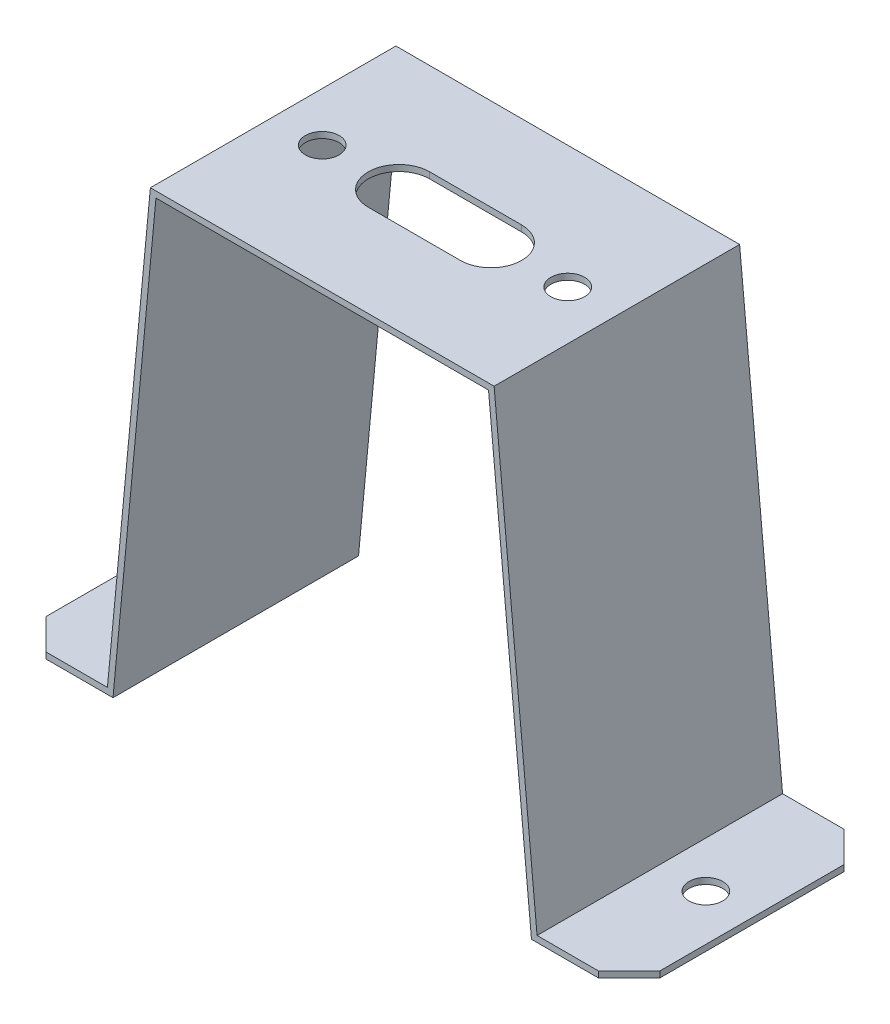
from build123d import *

# Parameters (mm, degrees)
EXTRUDE1_DEPTH     = 40
SKETCH2_R          = 2.75
CUT_EXTRUDE1_DEPTH = 40
SKETCH3_R          = 2.75
CUT_EXTRUDE2_DEPTH = 40
CHAMFER1_SIZE      = 5
CHAMFER2_SIZE      = 5


with BuildPart() as part:
    # Sketch1 → Extrude1 (new body)
    with BuildSketch(Plane.XY):
        Polygon((0, 0), (15.90986951, 0), (22.90986951, 74), (77.09013049, 74), (84.09013049, 0), (100, 0), (100, 1), (85, 1), (78, 75), (22, 75), (15, 1), (0, 1), align=None)
    extrude(amount=EXTRUDE1_DEPTH)

    # Sketch2 → Cut-Extrude1 (cut)
    with BuildSketch(Plane(origin=(0, 75, 0), x_dir=(-1, 0, 0), z_dir=(0, 1, 0))):
        with Locations(Location((-70, 20, 0), (0, 0, 90))):
            Circle(SKETCH2_R)
        with Locations(Location((-30, 20, 0), (0, 0, 90))):
            Circle(SKETCH2_R)
        with BuildLine():
            Line((-42.5, 25), (-57.5, 25))
            ThreePointArc((-57.5, 25), (-62.5, 20), (-57.5, 15))
            Line((-57.5, 15), (-42.5, 15))
            ThreePointArc((-42.5, 15), (-37.5, 20), (-42.5, 25))
        make_face()
    extrude(amount=-CUT_EXTRUDE1_DEPTH, mode=Mode.SUBTRACT)

    # Sketch3 → Cut-Extrude2 (cut)
    with BuildSketch(Plane(origin=(0, 1, 0), x_dir=(-1, 0, 0), z_dir=(0, 1, 0))):
        with Locations(Location((-92.5, 20, 0), (0, 0, 90))):
            Circle(SKETCH3_R)
        with Locations(Location((-7.5, 20, 0), (0, 0, 90))):
            Circle(SKETCH3_R)
    extrude(amount=-CUT_EXTRUDE2_DEPTH, mode=Mode.SUBTRACT)

    # Chamfer1
    chamfer1_edges = [part.edges().sort_by_distance(p)[0] for p in [
        (0, 0.5, 0),
        (0, 0.5, 40),
    ]]
    chamfer(chamfer1_edges, length=CHAMFER1_SIZE)

    # Chamfer2
    chamfer2_edges = [part.edges().sort_by_distance(p)[0] for p in [
        (100, 0.5, 0),
        (100, 0.5, 40),
    ]]
    chamfer(chamfer2_edges, length=CHAMFER2_SIZE)


solid = part.part
